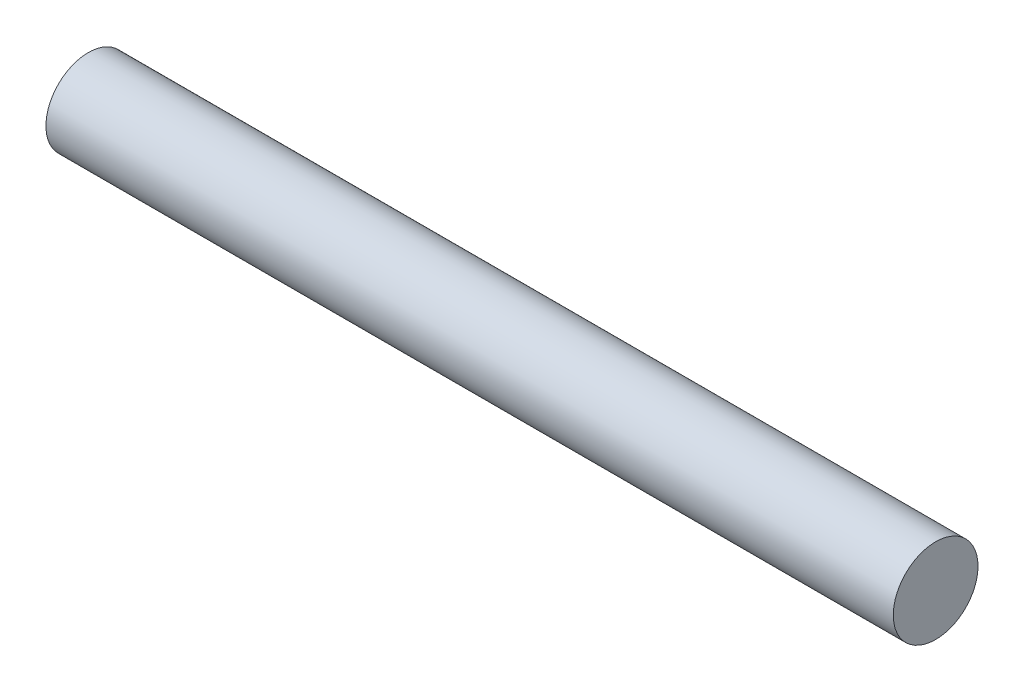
from build123d import *

# Parameters (mm, degrees)
SKETCH1_R           = 2
BOSS_EXTRUDE1_DEPTH = 20


with BuildPart() as part:
    # Sketch1 → Boss-Extrude1 (new, symmetric)
    with BuildSketch(Plane(origin=(0, 0, 0), x_dir=(0, 0, -1), z_dir=(1, 0, 0))):
        Circle(SKETCH1_R)
    extrude(amount=BOSS_EXTRUDE1_DEPTH, both=True)


solid = part.part
